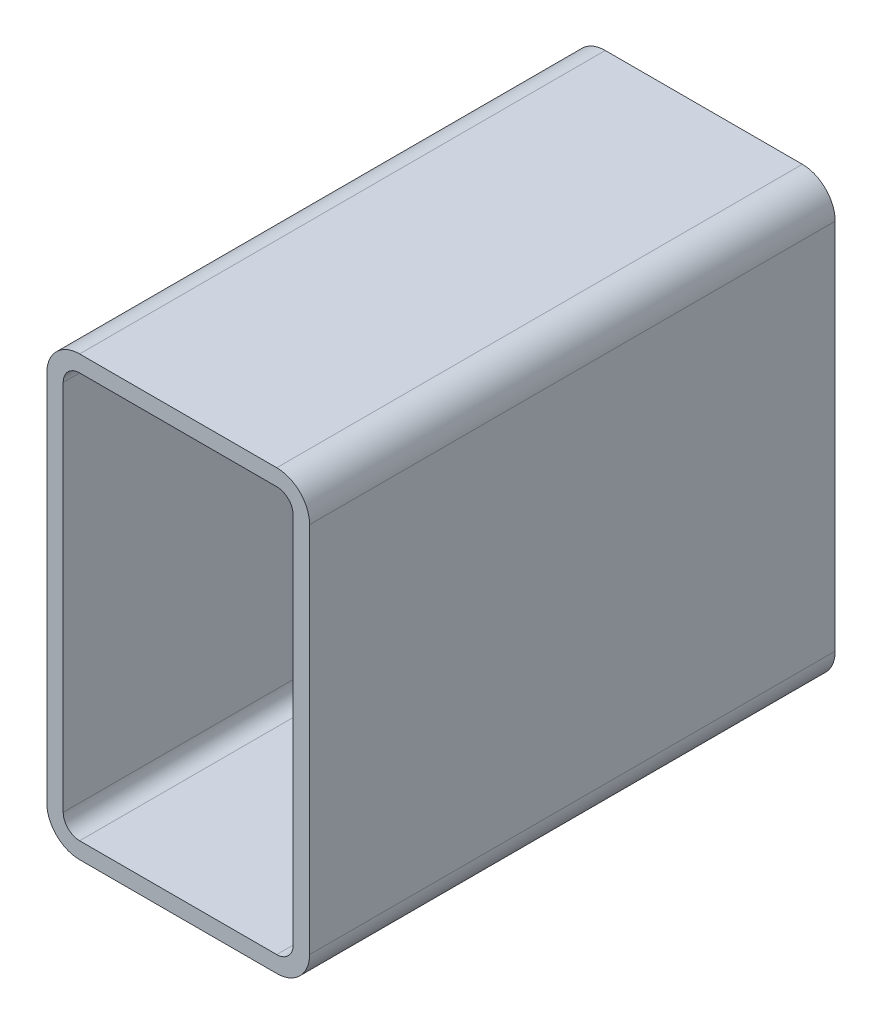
ISO-10303-21;
HEADER;
FILE_DESCRIPTION(('STEP AP214'),'2;1');
FILE_NAME('part.step','',(''),(''),'','','');
FILE_SCHEMA(('AUTOMOTIVE_DESIGN { 1 0 10303 214 1 1 1 1 }'));
ENDSEC;
DATA;
#1=APPLICATION_CONTEXT('core data for automotive mechanical design processes');
#2=APPLICATION_PROTOCOL_DEFINITION('international standard','automotive_design',2000,#1);
#3=PRODUCT_CONTEXT('',#1,'mechanical');
#4=PRODUCT('Part','Part','',(#3));
#5=PRODUCT_RELATED_PRODUCT_CATEGORY('part','',(#4));
#6=PRODUCT_DEFINITION_FORMATION('','',#4);
#7=PRODUCT_DEFINITION_CONTEXT('part definition',#1,'design');
#8=PRODUCT_DEFINITION('design','',#6,#7);
#9=PRODUCT_DEFINITION_SHAPE('','',#8);
#10=(LENGTH_UNIT() NAMED_UNIT(*) SI_UNIT(.MILLI.,.METRE.));
#11=(NAMED_UNIT(*) PLANE_ANGLE_UNIT() SI_UNIT($,.RADIAN.));
#12=(NAMED_UNIT(*) SI_UNIT($,.STERADIAN.) SOLID_ANGLE_UNIT());
#13=UNCERTAINTY_MEASURE_WITH_UNIT(LENGTH_MEASURE(1.E-05),#10,'distance_accuracy_value','');
#14=(GEOMETRIC_REPRESENTATION_CONTEXT(3) GLOBAL_UNCERTAINTY_ASSIGNED_CONTEXT((#13)) GLOBAL_UNIT_ASSIGNED_CONTEXT((#10,
#11,#12)) REPRESENTATION_CONTEXT('',''));
#15=CARTESIAN_POINT('',(0.,0.,0.));
#16=DIRECTION('',(0.,0.,1.));
#17=DIRECTION('',(1.,0.,0.));
#18=AXIS2_PLACEMENT_3D('',#15,#16,#17);
#19=CARTESIAN_POINT('',(19.0973013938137,236.870313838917,304.8));
#20=DIRECTION('',(0.,0.,1.));
#21=DIRECTION('',(1.,0.,0.));
#22=AXIS2_PLACEMENT_3D('',#19,#20,#21);
#23=PLANE('',#22);
#24=CARTESIAN_POINT('',(19.0973013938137,236.870313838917,304.8));
#25=DIRECTION('',(0.,0.,1.));
#26=DIRECTION('',(1.,0.,0.));
#27=AXIS2_PLACEMENT_3D('',#24,#25,#26);
#28=CIRCLE('',#27,19.05);
#29=CARTESIAN_POINT('',(19.0973013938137,255.920313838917,304.8));
#30=VERTEX_POINT('',#29);
#31=CARTESIAN_POINT('',(0.0473013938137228,236.870313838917,304.8));
#32=VERTEX_POINT('',#31);
#33=EDGE_CURVE('E211',#30,#32,#28,.T.);
#34=ORIENTED_EDGE('',*,*,#33,.T.);
#35=DIRECTION('',(0.,-1.,0.));
#36=VECTOR('',#35,1.);
#37=CARTESIAN_POINT('',(0.0473013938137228,20.9703138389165,304.8));
#38=LINE('',#37,#36);
#39=CARTESIAN_POINT('',(0.0473013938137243,20.9703138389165,304.8));
#40=VERTEX_POINT('',#39);
#41=EDGE_CURVE('E214',#32,#40,#38,.T.);
#42=ORIENTED_EDGE('',*,*,#41,.T.);
#43=CARTESIAN_POINT('',(19.0973013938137,20.9703138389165,304.8));
#44=DIRECTION('',(0.,0.,1.));
#45=DIRECTION('',(1.,0.,0.));
#46=AXIS2_PLACEMENT_3D('',#43,#44,#45);
#47=CIRCLE('',#46,19.05);
#48=CARTESIAN_POINT('',(19.0973013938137,1.92031383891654,304.8));
#49=VERTEX_POINT('',#48);
#50=EDGE_CURVE('E217',#40,#49,#47,.T.);
#51=ORIENTED_EDGE('',*,*,#50,.T.);
#52=DIRECTION('',(1.,0.,0.));
#53=VECTOR('',#52,1.);
#54=CARTESIAN_POINT('',(133.397301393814,1.92031383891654,304.8));
#55=LINE('',#54,#53);
#56=CARTESIAN_POINT('',(133.397301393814,1.92031383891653,304.8));
#57=VERTEX_POINT('',#56);
#58=EDGE_CURVE('E219',#49,#57,#55,.T.);
#59=ORIENTED_EDGE('',*,*,#58,.T.);
#60=CARTESIAN_POINT('',(133.397301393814,20.9703138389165,304.8));
#61=DIRECTION('',(0.,0.,1.));
#62=DIRECTION('',(1.,0.,0.));
#63=AXIS2_PLACEMENT_3D('',#60,#61,#62);
#64=CIRCLE('',#63,19.05);
#65=CARTESIAN_POINT('',(152.447301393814,20.9703138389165,304.8));
#66=VERTEX_POINT('',#65);
#67=EDGE_CURVE('E221',#57,#66,#64,.T.);
#68=ORIENTED_EDGE('',*,*,#67,.T.);
#69=DIRECTION('',(0.,1.,0.));
#70=VECTOR('',#69,1.);
#71=CARTESIAN_POINT('',(152.447301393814,236.870313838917,304.8));
#72=LINE('',#71,#70);
#73=CARTESIAN_POINT('',(152.447301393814,236.870313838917,304.8));
#74=VERTEX_POINT('',#73);
#75=EDGE_CURVE('E223',#66,#74,#72,.T.);
#76=ORIENTED_EDGE('',*,*,#75,.T.);
#77=CARTESIAN_POINT('',(133.397301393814,236.870313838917,304.8));
#78=DIRECTION('',(0.,0.,1.));
#79=DIRECTION('',(1.,0.,0.));
#80=AXIS2_PLACEMENT_3D('',#77,#78,#79);
#81=CIRCLE('',#80,19.05);
#82=CARTESIAN_POINT('',(133.397301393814,255.920313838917,304.8));
#83=VERTEX_POINT('',#82);
#84=EDGE_CURVE('E225',#74,#83,#81,.T.);
#85=ORIENTED_EDGE('',*,*,#84,.T.);
#86=DIRECTION('',(-1.,0.,0.));
#87=VECTOR('',#86,1.);
#88=CARTESIAN_POINT('',(19.0973013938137,255.920313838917,304.8));
#89=LINE('',#88,#87);
#90=EDGE_CURVE('E227',#83,#30,#89,.T.);
#91=ORIENTED_EDGE('',*,*,#90,.T.);
#92=EDGE_LOOP('',(#34,#42,#51,#59,#68,#76,#85,#91));
#93=FACE_BOUND('',#92,.T.);
#94=DIRECTION('',(0.,-1.,0.));
#95=VECTOR('',#94,1.);
#96=CARTESIAN_POINT('',(9.57230139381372,20.9703138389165,304.8));
#97=LINE('',#96,#95);
#98=CARTESIAN_POINT('',(9.57230139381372,236.870313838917,304.8));
#99=VERTEX_POINT('',#98);
#100=CARTESIAN_POINT('',(9.57230139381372,20.9703138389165,304.8));
#101=VERTEX_POINT('',#100);
#102=EDGE_CURVE('E154',#99,#101,#97,.T.);
#103=ORIENTED_EDGE('',*,*,#102,.F.);
#104=CARTESIAN_POINT('',(19.0973013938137,236.870313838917,304.8));
#105=DIRECTION('',(0.,0.,1.));
#106=DIRECTION('',(1.,0.,0.));
#107=AXIS2_PLACEMENT_3D('',#104,#105,#106);
#108=CIRCLE('',#107,9.52500000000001);
#109=CARTESIAN_POINT('',(19.0973013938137,246.395313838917,304.8));
#110=VERTEX_POINT('',#109);
#111=EDGE_CURVE('E146',#110,#99,#108,.T.);
#112=ORIENTED_EDGE('',*,*,#111,.F.);
#113=DIRECTION('',(-1.,0.,0.));
#114=VECTOR('',#113,1.);
#115=CARTESIAN_POINT('',(19.0973013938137,246.395313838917,304.8));
#116=LINE('',#115,#114);
#117=CARTESIAN_POINT('',(133.397301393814,246.395313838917,304.8));
#118=VERTEX_POINT('',#117);
#119=EDGE_CURVE('E179',#118,#110,#116,.T.);
#120=ORIENTED_EDGE('',*,*,#119,.F.);
#121=CARTESIAN_POINT('',(133.397301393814,236.870313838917,304.8));
#122=DIRECTION('',(0.,0.,1.));
#123=DIRECTION('',(1.,0.,0.));
#124=AXIS2_PLACEMENT_3D('',#121,#122,#123);
#125=CIRCLE('',#124,9.52500000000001);
#126=CARTESIAN_POINT('',(142.922301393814,236.870313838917,304.8));
#127=VERTEX_POINT('',#126);
#128=EDGE_CURVE('E177',#127,#118,#125,.T.);
#129=ORIENTED_EDGE('',*,*,#128,.F.);
#130=DIRECTION('',(0.,1.,0.));
#131=VECTOR('',#130,1.);
#132=CARTESIAN_POINT('',(142.922301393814,236.870313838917,304.8));
#133=LINE('',#132,#131);
#134=CARTESIAN_POINT('',(142.922301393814,20.9703138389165,304.8));
#135=VERTEX_POINT('',#134);
#136=EDGE_CURVE('E175',#135,#127,#133,.T.);
#137=ORIENTED_EDGE('',*,*,#136,.F.);
#138=CARTESIAN_POINT('',(133.397301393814,20.9703138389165,304.8));
#139=DIRECTION('',(0.,0.,1.));
#140=DIRECTION('',(1.,0.,0.));
#141=AXIS2_PLACEMENT_3D('',#138,#139,#140);
#142=CIRCLE('',#141,9.525);
#143=CARTESIAN_POINT('',(133.397301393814,11.4453138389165,304.8));
#144=VERTEX_POINT('',#143);
#145=EDGE_CURVE('E173',#144,#135,#142,.T.);
#146=ORIENTED_EDGE('',*,*,#145,.F.);
#147=DIRECTION('',(1.,0.,0.));
#148=VECTOR('',#147,1.);
#149=CARTESIAN_POINT('',(133.397301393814,11.4453138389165,304.8));
#150=LINE('',#149,#148);
#151=CARTESIAN_POINT('',(19.0973013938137,11.4453138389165,304.8));
#152=VERTEX_POINT('',#151);
#153=EDGE_CURVE('E169',#152,#144,#150,.T.);
#154=ORIENTED_EDGE('',*,*,#153,.F.);
#155=CARTESIAN_POINT('',(19.0973013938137,20.9703138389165,304.8));
#156=DIRECTION('',(0.,0.,1.));
#157=DIRECTION('',(1.,0.,0.));
#158=AXIS2_PLACEMENT_3D('',#155,#156,#157);
#159=CIRCLE('',#158,9.525);
#160=EDGE_CURVE('E167',#101,#152,#159,.T.);
#161=ORIENTED_EDGE('',*,*,#160,.F.);
#162=EDGE_LOOP('',(#103,#112,#120,#129,#137,#146,#154,#161));
#163=FACE_BOUND('',#162,.T.);
#164=ADVANCED_FACE('F33',(#93,#163),#23,.T.);
#165=CARTESIAN_POINT('',(19.0973013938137,236.870313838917,0.));
#166=DIRECTION('',(0.,0.,1.));
#167=DIRECTION('',(1.,0.,0.));
#168=AXIS2_PLACEMENT_3D('',#165,#166,#167);
#169=PLANE('',#168);
#170=CARTESIAN_POINT('',(19.0973013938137,236.870313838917,0.));
#171=DIRECTION('',(0.,0.,1.));
#172=DIRECTION('',(1.,0.,0.));
#173=AXIS2_PLACEMENT_3D('',#170,#171,#172);
#174=CIRCLE('',#173,19.05);
#175=CARTESIAN_POINT('',(19.0973013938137,255.920313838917,0.));
#176=VERTEX_POINT('',#175);
#177=CARTESIAN_POINT('',(0.0473013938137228,236.870313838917,0.));
#178=VERTEX_POINT('',#177);
#179=EDGE_CURVE('E162',#176,#178,#174,.T.);
#180=ORIENTED_EDGE('',*,*,#179,.F.);
#181=DIRECTION('',(-1.,0.,0.));
#182=VECTOR('',#181,1.);
#183=CARTESIAN_POINT('',(19.0973013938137,255.920313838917,0.));
#184=LINE('',#183,#182);
#185=CARTESIAN_POINT('',(133.397301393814,255.920313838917,0.));
#186=VERTEX_POINT('',#185);
#187=EDGE_CURVE('E215',#186,#176,#184,.T.);
#188=ORIENTED_EDGE('',*,*,#187,.F.);
#189=CARTESIAN_POINT('',(133.397301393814,236.870313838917,0.));
#190=DIRECTION('',(0.,0.,1.));
#191=DIRECTION('',(1.,0.,0.));
#192=AXIS2_PLACEMENT_3D('',#189,#190,#191);
#193=CIRCLE('',#192,19.05);
#194=CARTESIAN_POINT('',(152.447301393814,236.870313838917,0.));
#195=VERTEX_POINT('',#194);
#196=EDGE_CURVE('E242',#195,#186,#193,.T.);
#197=ORIENTED_EDGE('',*,*,#196,.F.);
#198=DIRECTION('',(0.,1.,0.));
#199=VECTOR('',#198,1.);
#200=CARTESIAN_POINT('',(152.447301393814,236.870313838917,0.));
#201=LINE('',#200,#199);
#202=CARTESIAN_POINT('',(152.447301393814,20.9703138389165,0.));
#203=VERTEX_POINT('',#202);
#204=EDGE_CURVE('E240',#203,#195,#201,.T.);
#205=ORIENTED_EDGE('',*,*,#204,.F.);
#206=CARTESIAN_POINT('',(133.397301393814,20.9703138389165,0.));
#207=DIRECTION('',(0.,0.,1.));
#208=DIRECTION('',(1.,0.,0.));
#209=AXIS2_PLACEMENT_3D('',#206,#207,#208);
#210=CIRCLE('',#209,19.05);
#211=CARTESIAN_POINT('',(133.397301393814,1.92031383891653,0.));
#212=VERTEX_POINT('',#211);
#213=EDGE_CURVE('E238',#212,#203,#210,.T.);
#214=ORIENTED_EDGE('',*,*,#213,.F.);
#215=DIRECTION('',(1.,0.,0.));
#216=VECTOR('',#215,1.);
#217=CARTESIAN_POINT('',(133.397301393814,1.92031383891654,0.));
#218=LINE('',#217,#216);
#219=CARTESIAN_POINT('',(19.0973013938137,1.92031383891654,0.));
#220=VERTEX_POINT('',#219);
#221=EDGE_CURVE('E236',#220,#212,#218,.T.);
#222=ORIENTED_EDGE('',*,*,#221,.F.);
#223=CARTESIAN_POINT('',(19.0973013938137,20.9703138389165,0.));
#224=DIRECTION('',(0.,0.,1.));
#225=DIRECTION('',(1.,0.,0.));
#226=AXIS2_PLACEMENT_3D('',#223,#224,#225);
#227=CIRCLE('',#226,19.05);
#228=CARTESIAN_POINT('',(0.0473013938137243,20.9703138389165,0.));
#229=VERTEX_POINT('',#228);
#230=EDGE_CURVE('E234',#229,#220,#227,.T.);
#231=ORIENTED_EDGE('',*,*,#230,.F.);
#232=DIRECTION('',(0.,-1.,0.));
#233=VECTOR('',#232,1.);
#234=CARTESIAN_POINT('',(0.0473013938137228,20.9703138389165,0.));
#235=LINE('',#234,#233);
#236=EDGE_CURVE('E232',#178,#229,#235,.T.);
#237=ORIENTED_EDGE('',*,*,#236,.F.);
#238=EDGE_LOOP('',(#180,#188,#197,#205,#214,#222,#231,#237));
#239=FACE_BOUND('',#238,.T.);
#240=CARTESIAN_POINT('',(19.0973013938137,236.870313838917,0.));
#241=DIRECTION('',(0.,0.,1.));
#242=DIRECTION('',(1.,0.,0.));
#243=AXIS2_PLACEMENT_3D('',#240,#241,#242);
#244=CIRCLE('',#243,9.52500000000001);
#245=CARTESIAN_POINT('',(19.0973013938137,246.395313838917,0.));
#246=VERTEX_POINT('',#245);
#247=CARTESIAN_POINT('',(9.57230139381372,236.870313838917,0.));
#248=VERTEX_POINT('',#247);
#249=EDGE_CURVE('E56',#246,#248,#244,.T.);
#250=ORIENTED_EDGE('',*,*,#249,.T.);
#251=DIRECTION('',(0.,-1.,0.));
#252=VECTOR('',#251,1.);
#253=CARTESIAN_POINT('',(9.57230139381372,20.9703138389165,0.));
#254=LINE('',#253,#252);
#255=CARTESIAN_POINT('',(9.57230139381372,20.9703138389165,0.));
#256=VERTEX_POINT('',#255);
#257=EDGE_CURVE('E161',#248,#256,#254,.T.);
#258=ORIENTED_EDGE('',*,*,#257,.T.);
#259=CARTESIAN_POINT('',(19.0973013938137,20.9703138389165,0.));
#260=DIRECTION('',(0.,0.,1.));
#261=DIRECTION('',(1.,0.,0.));
#262=AXIS2_PLACEMENT_3D('',#259,#260,#261);
#263=CIRCLE('',#262,9.525);
#264=CARTESIAN_POINT('',(19.0973013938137,11.4453138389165,0.));
#265=VERTEX_POINT('',#264);
#266=EDGE_CURVE('E183',#256,#265,#263,.T.);
#267=ORIENTED_EDGE('',*,*,#266,.T.);
#268=DIRECTION('',(1.,0.,0.));
#269=VECTOR('',#268,1.);
#270=CARTESIAN_POINT('',(133.397301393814,11.4453138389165,0.));
#271=LINE('',#270,#269);
#272=CARTESIAN_POINT('',(133.397301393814,11.4453138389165,0.));
#273=VERTEX_POINT('',#272);
#274=EDGE_CURVE('E186',#265,#273,#271,.T.);
#275=ORIENTED_EDGE('',*,*,#274,.T.);
#276=CARTESIAN_POINT('',(133.397301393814,20.9703138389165,0.));
#277=DIRECTION('',(0.,0.,1.));
#278=DIRECTION('',(1.,0.,0.));
#279=AXIS2_PLACEMENT_3D('',#276,#277,#278);
#280=CIRCLE('',#279,9.525);
#281=CARTESIAN_POINT('',(142.922301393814,20.9703138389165,0.));
#282=VERTEX_POINT('',#281);
#283=EDGE_CURVE('E189',#273,#282,#280,.T.);
#284=ORIENTED_EDGE('',*,*,#283,.T.);
#285=DIRECTION('',(0.,1.,0.));
#286=VECTOR('',#285,1.);
#287=CARTESIAN_POINT('',(142.922301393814,236.870313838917,0.));
#288=LINE('',#287,#286);
#289=CARTESIAN_POINT('',(142.922301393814,236.870313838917,0.));
#290=VERTEX_POINT('',#289);
#291=EDGE_CURVE('E192',#282,#290,#288,.T.);
#292=ORIENTED_EDGE('',*,*,#291,.T.);
#293=CARTESIAN_POINT('',(133.397301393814,236.870313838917,0.));
#294=DIRECTION('',(0.,0.,1.));
#295=DIRECTION('',(1.,0.,0.));
#296=AXIS2_PLACEMENT_3D('',#293,#294,#295);
#297=CIRCLE('',#296,9.52500000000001);
#298=CARTESIAN_POINT('',(133.397301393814,246.395313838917,0.));
#299=VERTEX_POINT('',#298);
#300=EDGE_CURVE('E195',#290,#299,#297,.T.);
#301=ORIENTED_EDGE('',*,*,#300,.T.);
#302=DIRECTION('',(-1.,0.,0.));
#303=VECTOR('',#302,1.);
#304=CARTESIAN_POINT('',(19.0973013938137,246.395313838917,0.));
#305=LINE('',#304,#303);
#306=EDGE_CURVE('E155',#299,#246,#305,.T.);
#307=ORIENTED_EDGE('',*,*,#306,.T.);
#308=EDGE_LOOP('',(#250,#258,#267,#275,#284,#292,#301,#307));
#309=FACE_BOUND('',#308,.T.);
#310=ADVANCED_FACE('F272',(#239,#309),#169,.F.);
#311=CARTESIAN_POINT('',(19.0973013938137,236.870313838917,304.8));
#312=DIRECTION('',(0.,0.,-1.));
#313=DIRECTION('',(-1.,0.,0.));
#314=AXIS2_PLACEMENT_3D('',#311,#312,#313);
#315=CYLINDRICAL_SURFACE('',#314,19.05);
#316=ORIENTED_EDGE('',*,*,#179,.T.);
#317=DIRECTION('',(0.,0.,-1.));
#318=VECTOR('',#317,1.);
#319=CARTESIAN_POINT('',(0.0473013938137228,236.870313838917,304.8));
#320=LINE('',#319,#318);
#321=EDGE_CURVE('E11',#32,#178,#320,.T.);
#322=ORIENTED_EDGE('',*,*,#321,.F.);
#323=ORIENTED_EDGE('',*,*,#33,.F.);
#324=DIRECTION('',(0.,0.,-1.));
#325=VECTOR('',#324,1.);
#326=CARTESIAN_POINT('',(19.0973013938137,255.920313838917,304.8));
#327=LINE('',#326,#325);
#328=EDGE_CURVE('E229',#30,#176,#327,.T.);
#329=ORIENTED_EDGE('',*,*,#328,.T.);
#330=EDGE_LOOP('',(#316,#322,#323,#329));
#331=FACE_BOUND('',#330,.T.);
#332=ADVANCED_FACE('F35',(#331),#315,.T.);
#333=CARTESIAN_POINT('',(0.0473013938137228,20.9703138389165,304.8));
#334=DIRECTION('',(1.,0.,0.));
#335=DIRECTION('',(0.,0.,-1.));
#336=AXIS2_PLACEMENT_3D('',#333,#334,#335);
#337=PLANE('',#336);
#338=ORIENTED_EDGE('',*,*,#236,.T.);
#339=DIRECTION('',(0.,0.,-1.));
#340=VECTOR('',#339,1.);
#341=CARTESIAN_POINT('',(0.0473013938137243,20.9703138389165,304.8));
#342=LINE('',#341,#340);
#343=EDGE_CURVE('E41',#40,#229,#342,.T.);
#344=ORIENTED_EDGE('',*,*,#343,.F.);
#345=ORIENTED_EDGE('',*,*,#41,.F.);
#346=ORIENTED_EDGE('',*,*,#321,.T.);
#347=EDGE_LOOP('',(#338,#344,#345,#346));
#348=FACE_BOUND('',#347,.T.);
#349=ADVANCED_FACE('F289',(#348),#337,.F.);
#350=CARTESIAN_POINT('',(19.0973013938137,20.9703138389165,304.8));
#351=DIRECTION('',(0.,0.,-1.));
#352=DIRECTION('',(-1.,0.,0.));
#353=AXIS2_PLACEMENT_3D('',#350,#351,#352);
#354=CYLINDRICAL_SURFACE('',#353,19.05);
#355=ORIENTED_EDGE('',*,*,#230,.T.);
#356=DIRECTION('',(0.,0.,-1.));
#357=VECTOR('',#356,1.);
#358=CARTESIAN_POINT('',(19.0973013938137,1.92031383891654,304.8));
#359=LINE('',#358,#357);
#360=EDGE_CURVE('E259',#49,#220,#359,.T.);
#361=ORIENTED_EDGE('',*,*,#360,.F.);
#362=ORIENTED_EDGE('',*,*,#50,.F.);
#363=ORIENTED_EDGE('',*,*,#343,.T.);
#364=EDGE_LOOP('',(#355,#361,#362,#363));
#365=FACE_BOUND('',#364,.T.);
#366=ADVANCED_FACE('F266',(#365),#354,.T.);
#367=CARTESIAN_POINT('',(133.397301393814,1.92031383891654,304.8));
#368=DIRECTION('',(0.,1.,0.));
#369=DIRECTION('',(0.,0.,1.));
#370=AXIS2_PLACEMENT_3D('',#367,#368,#369);
#371=PLANE('',#370);
#372=ORIENTED_EDGE('',*,*,#221,.T.);
#373=DIRECTION('',(0.,0.,-1.));
#374=VECTOR('',#373,1.);
#375=CARTESIAN_POINT('',(133.397301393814,1.92031383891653,304.8));
#376=LINE('',#375,#374);
#377=EDGE_CURVE('E256',#57,#212,#376,.T.);
#378=ORIENTED_EDGE('',*,*,#377,.F.);
#379=ORIENTED_EDGE('',*,*,#58,.F.);
#380=ORIENTED_EDGE('',*,*,#360,.T.);
#381=EDGE_LOOP('',(#372,#378,#379,#380));
#382=FACE_BOUND('',#381,.T.);
#383=ADVANCED_FACE('F278',(#382),#371,.F.);
#384=CARTESIAN_POINT('',(133.397301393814,20.9703138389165,304.8));
#385=DIRECTION('',(0.,0.,-1.));
#386=DIRECTION('',(-1.,0.,0.));
#387=AXIS2_PLACEMENT_3D('',#384,#385,#386);
#388=CYLINDRICAL_SURFACE('',#387,19.05);
#389=ORIENTED_EDGE('',*,*,#213,.T.);
#390=DIRECTION('',(0.,0.,-1.));
#391=VECTOR('',#390,1.);
#392=CARTESIAN_POINT('',(152.447301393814,20.9703138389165,304.8));
#393=LINE('',#392,#391);
#394=EDGE_CURVE('E253',#66,#203,#393,.T.);
#395=ORIENTED_EDGE('',*,*,#394,.F.);
#396=ORIENTED_EDGE('',*,*,#67,.F.);
#397=ORIENTED_EDGE('',*,*,#377,.T.);
#398=EDGE_LOOP('',(#389,#395,#396,#397));
#399=FACE_BOUND('',#398,.T.);
#400=ADVANCED_FACE('F282',(#399),#388,.T.);
#401=CARTESIAN_POINT('',(152.447301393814,236.870313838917,304.8));
#402=DIRECTION('',(-1.,0.,0.));
#403=DIRECTION('',(0.,0.,1.));
#404=AXIS2_PLACEMENT_3D('',#401,#402,#403);
#405=PLANE('',#404);
#406=ORIENTED_EDGE('',*,*,#204,.T.);
#407=DIRECTION('',(0.,0.,-1.));
#408=VECTOR('',#407,1.);
#409=CARTESIAN_POINT('',(152.447301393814,236.870313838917,304.8));
#410=LINE('',#409,#408);
#411=EDGE_CURVE('E250',#74,#195,#410,.T.);
#412=ORIENTED_EDGE('',*,*,#411,.F.);
#413=ORIENTED_EDGE('',*,*,#75,.F.);
#414=ORIENTED_EDGE('',*,*,#394,.T.);
#415=EDGE_LOOP('',(#406,#412,#413,#414));
#416=FACE_BOUND('',#415,.T.);
#417=ADVANCED_FACE('F302',(#416),#405,.F.);
#418=CARTESIAN_POINT('',(133.397301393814,236.870313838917,304.8));
#419=DIRECTION('',(0.,0.,-1.));
#420=DIRECTION('',(-1.,0.,0.));
#421=AXIS2_PLACEMENT_3D('',#418,#419,#420);
#422=CYLINDRICAL_SURFACE('',#421,19.05);
#423=ORIENTED_EDGE('',*,*,#196,.T.);
#424=DIRECTION('',(0.,0.,-1.));
#425=VECTOR('',#424,1.);
#426=CARTESIAN_POINT('',(133.397301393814,255.920313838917,304.8));
#427=LINE('',#426,#425);
#428=EDGE_CURVE('E247',#83,#186,#427,.T.);
#429=ORIENTED_EDGE('',*,*,#428,.F.);
#430=ORIENTED_EDGE('',*,*,#84,.F.);
#431=ORIENTED_EDGE('',*,*,#411,.T.);
#432=EDGE_LOOP('',(#423,#429,#430,#431));
#433=FACE_BOUND('',#432,.T.);
#434=ADVANCED_FACE('F300',(#433),#422,.T.);
#435=CARTESIAN_POINT('',(19.0973013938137,255.920313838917,304.8));
#436=DIRECTION('',(0.,-1.,0.));
#437=DIRECTION('',(0.,0.,-1.));
#438=AXIS2_PLACEMENT_3D('',#435,#436,#437);
#439=PLANE('',#438);
#440=ORIENTED_EDGE('',*,*,#187,.T.);
#441=ORIENTED_EDGE('',*,*,#328,.F.);
#442=ORIENTED_EDGE('',*,*,#90,.F.);
#443=ORIENTED_EDGE('',*,*,#428,.T.);
#444=EDGE_LOOP('',(#440,#441,#442,#443));
#445=FACE_BOUND('',#444,.T.);
#446=ADVANCED_FACE('F295',(#445),#439,.F.);
#447=CARTESIAN_POINT('',(19.0973013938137,236.870313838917,304.8));
#448=DIRECTION('',(0.,0.,-1.));
#449=DIRECTION('',(-1.,0.,0.));
#450=AXIS2_PLACEMENT_3D('',#447,#448,#449);
#451=CYLINDRICAL_SURFACE('',#450,9.52500000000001);
#452=ORIENTED_EDGE('',*,*,#249,.F.);
#453=DIRECTION('',(0.,0.,-1.));
#454=VECTOR('',#453,1.);
#455=CARTESIAN_POINT('',(19.0973013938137,246.395313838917,304.8));
#456=LINE('',#455,#454);
#457=EDGE_CURVE('E150',#110,#246,#456,.T.);
#458=ORIENTED_EDGE('',*,*,#457,.F.);
#459=ORIENTED_EDGE('',*,*,#111,.T.);
#460=DIRECTION('',(0.,0.,-1.));
#461=VECTOR('',#460,1.);
#462=CARTESIAN_POINT('',(9.57230139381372,236.870313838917,304.8));
#463=LINE('',#462,#461);
#464=EDGE_CURVE('E149',#99,#248,#463,.T.);
#465=ORIENTED_EDGE('',*,*,#464,.T.);
#466=EDGE_LOOP('',(#452,#458,#459,#465));
#467=FACE_BOUND('',#466,.T.);
#468=ADVANCED_FACE('F148',(#467),#451,.F.);
#469=CARTESIAN_POINT('',(9.57230139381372,20.9703138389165,304.8));
#470=DIRECTION('',(1.,0.,0.));
#471=DIRECTION('',(0.,0.,-1.));
#472=AXIS2_PLACEMENT_3D('',#469,#470,#471);
#473=PLANE('',#472);
#474=ORIENTED_EDGE('',*,*,#257,.F.);
#475=ORIENTED_EDGE('',*,*,#464,.F.);
#476=ORIENTED_EDGE('',*,*,#102,.T.);
#477=DIRECTION('',(0.,0.,-1.));
#478=VECTOR('',#477,1.);
#479=CARTESIAN_POINT('',(9.57230139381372,20.9703138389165,304.8));
#480=LINE('',#479,#478);
#481=EDGE_CURVE('E163',#101,#256,#480,.T.);
#482=ORIENTED_EDGE('',*,*,#481,.T.);
#483=EDGE_LOOP('',(#474,#475,#476,#482));
#484=FACE_BOUND('',#483,.T.);
#485=ADVANCED_FACE('F158',(#484),#473,.T.);
#486=CARTESIAN_POINT('',(19.0973013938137,20.9703138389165,304.8));
#487=DIRECTION('',(0.,0.,-1.));
#488=DIRECTION('',(-1.,0.,0.));
#489=AXIS2_PLACEMENT_3D('',#486,#487,#488);
#490=CYLINDRICAL_SURFACE('',#489,9.525);
#491=ORIENTED_EDGE('',*,*,#266,.F.);
#492=ORIENTED_EDGE('',*,*,#481,.F.);
#493=ORIENTED_EDGE('',*,*,#160,.T.);
#494=DIRECTION('',(0.,0.,-1.));
#495=VECTOR('',#494,1.);
#496=CARTESIAN_POINT('',(19.0973013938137,11.4453138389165,304.8));
#497=LINE('',#496,#495);
#498=EDGE_CURVE('E208',#152,#265,#497,.T.);
#499=ORIENTED_EDGE('',*,*,#498,.T.);
#500=EDGE_LOOP('',(#491,#492,#493,#499));
#501=FACE_BOUND('',#500,.T.);
#502=ADVANCED_FACE('F327',(#501),#490,.F.);
#503=CARTESIAN_POINT('',(133.397301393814,11.4453138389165,304.8));
#504=DIRECTION('',(0.,1.,0.));
#505=DIRECTION('',(0.,0.,1.));
#506=AXIS2_PLACEMENT_3D('',#503,#504,#505);
#507=PLANE('',#506);
#508=ORIENTED_EDGE('',*,*,#274,.F.);
#509=ORIENTED_EDGE('',*,*,#498,.F.);
#510=ORIENTED_EDGE('',*,*,#153,.T.);
#511=DIRECTION('',(0.,0.,-1.));
#512=VECTOR('',#511,1.);
#513=CARTESIAN_POINT('',(133.397301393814,11.4453138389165,304.8));
#514=LINE('',#513,#512);
#515=EDGE_CURVE('E206',#144,#273,#514,.T.);
#516=ORIENTED_EDGE('',*,*,#515,.T.);
#517=EDGE_LOOP('',(#508,#509,#510,#516));
#518=FACE_BOUND('',#517,.T.);
#519=ADVANCED_FACE('F331',(#518),#507,.T.);
#520=CARTESIAN_POINT('',(133.397301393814,20.9703138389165,304.8));
#521=DIRECTION('',(0.,0.,-1.));
#522=DIRECTION('',(-1.,0.,0.));
#523=AXIS2_PLACEMENT_3D('',#520,#521,#522);
#524=CYLINDRICAL_SURFACE('',#523,9.525);
#525=ORIENTED_EDGE('',*,*,#283,.F.);
#526=ORIENTED_EDGE('',*,*,#515,.F.);
#527=ORIENTED_EDGE('',*,*,#145,.T.);
#528=DIRECTION('',(0.,0.,-1.));
#529=VECTOR('',#528,1.);
#530=CARTESIAN_POINT('',(142.922301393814,20.9703138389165,304.8));
#531=LINE('',#530,#529);
#532=EDGE_CURVE('E204',#135,#282,#531,.T.);
#533=ORIENTED_EDGE('',*,*,#532,.T.);
#534=EDGE_LOOP('',(#525,#526,#527,#533));
#535=FACE_BOUND('',#534,.T.);
#536=ADVANCED_FACE('F337',(#535),#524,.F.);
#537=CARTESIAN_POINT('',(142.922301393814,236.870313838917,304.8));
#538=DIRECTION('',(-1.,0.,0.));
#539=DIRECTION('',(0.,0.,1.));
#540=AXIS2_PLACEMENT_3D('',#537,#538,#539);
#541=PLANE('',#540);
#542=ORIENTED_EDGE('',*,*,#291,.F.);
#543=ORIENTED_EDGE('',*,*,#532,.F.);
#544=ORIENTED_EDGE('',*,*,#136,.T.);
#545=DIRECTION('',(0.,0.,-1.));
#546=VECTOR('',#545,1.);
#547=CARTESIAN_POINT('',(142.922301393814,236.870313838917,304.8));
#548=LINE('',#547,#546);
#549=EDGE_CURVE('E202',#127,#290,#548,.T.);
#550=ORIENTED_EDGE('',*,*,#549,.T.);
#551=EDGE_LOOP('',(#542,#543,#544,#550));
#552=FACE_BOUND('',#551,.T.);
#553=ADVANCED_FACE('F341',(#552),#541,.T.);
#554=CARTESIAN_POINT('',(133.397301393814,236.870313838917,304.8));
#555=DIRECTION('',(0.,0.,-1.));
#556=DIRECTION('',(-1.,0.,0.));
#557=AXIS2_PLACEMENT_3D('',#554,#555,#556);
#558=CYLINDRICAL_SURFACE('',#557,9.52500000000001);
#559=ORIENTED_EDGE('',*,*,#300,.F.);
#560=ORIENTED_EDGE('',*,*,#549,.F.);
#561=ORIENTED_EDGE('',*,*,#128,.T.);
#562=DIRECTION('',(0.,0.,-1.));
#563=VECTOR('',#562,1.);
#564=CARTESIAN_POINT('',(133.397301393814,246.395313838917,304.8));
#565=LINE('',#564,#563);
#566=EDGE_CURVE('E48',#118,#299,#565,.T.);
#567=ORIENTED_EDGE('',*,*,#566,.T.);
#568=EDGE_LOOP('',(#559,#560,#561,#567));
#569=FACE_BOUND('',#568,.T.);
#570=ADVANCED_FACE('F345',(#569),#558,.F.);
#571=CARTESIAN_POINT('',(19.0973013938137,246.395313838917,304.8));
#572=DIRECTION('',(0.,-1.,0.));
#573=DIRECTION('',(0.,0.,-1.));
#574=AXIS2_PLACEMENT_3D('',#571,#572,#573);
#575=PLANE('',#574);
#576=ORIENTED_EDGE('',*,*,#306,.F.);
#577=ORIENTED_EDGE('',*,*,#566,.F.);
#578=ORIENTED_EDGE('',*,*,#119,.T.);
#579=ORIENTED_EDGE('',*,*,#457,.T.);
#580=EDGE_LOOP('',(#576,#577,#578,#579));
#581=FACE_BOUND('',#580,.T.);
#582=ADVANCED_FACE('F349',(#581),#575,.T.);
#583=CLOSED_SHELL('',(#164,#310,#332,#349,#366,#383,#400,#417,#434,#446,#468,#485,#502,#519,
#536,#553,#570,#582));
#584=MANIFOLD_SOLID_BREP('B2',#583);
#585=ADVANCED_BREP_SHAPE_REPRESENTATION('',(#18,#584),#14);
#586=SHAPE_DEFINITION_REPRESENTATION(#9,#585);
ENDSEC;
END-ISO-10303-21;
